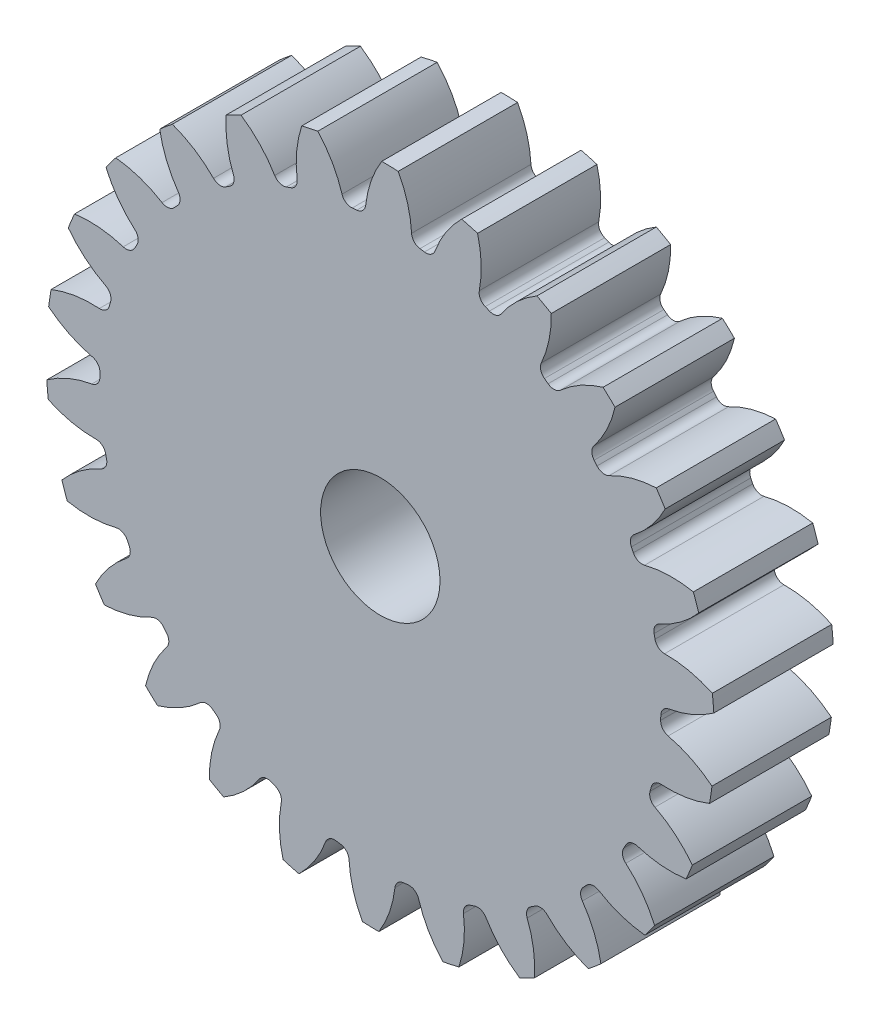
from build123d import *

# Parameters (mm, degrees)
SKETCH3_R         = 284.48
GEARBODY_DEPTH    = 101.6
TOOTHCUT_DEPTH    = 415.946142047
CIRPATTERN1_COUNT = 26
BOREDIA_R         = 50.8
BORE_DEPTH        = 12700


with BuildPart() as part:
    # Sketch3 → gearBody (new body)
    with BuildSketch(Plane.XY):
        Circle(SKETCH3_R)
    extrude(amount=GEARBODY_DEPTH)

    # Sketch2 → toothCut (cut, through all)
    with BuildSketch(Plane.XY):
        with BuildLine():
            ThreePointArc((238.596342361, -8.838722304), (238.660131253, -6.905023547), (238.708248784, -4.97087138))
            ThreePointArc((238.708248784, -4.97087138), (240.697371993, 0.239042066), (245.541681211, 3.001735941))
            ThreePointArc((245.541681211, 3.001735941), (265.963471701, 9.066514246), (284.48, 19.600708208))
            ThreePointArc((284.48, 19.600708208), (285.035171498, -8.24676732), (282.870884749, -36.015562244))
            ThreePointArc((282.870884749, -36.015562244), (264.994380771, -24.428428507), (244.957395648, -17.193078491))
            ThreePointArc((244.957395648, -17.193078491), (240.280919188, -14.154924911), (238.596342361, -8.838722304))
        make_face()
    toothcut = extrude(amount=TOOTHCUT_DEPTH, mode=Mode.SUBTRACT)

    # CirPattern1: toothCut ×26 about axis
    cirpattern1_axis = Axis((0, 0, 0), (0, 0, 1))
    for i in range(1, CIRPATTERN1_COUNT):
        add(toothcut.rotate(cirpattern1_axis, i * 360 / CIRPATTERN1_COUNT), mode=Mode.SUBTRACT)

    # boreDia → bore (cut, symmetric)
    with BuildSketch(Plane.XY):
        Circle(BOREDIA_R)
    extrude(amount=BORE_DEPTH, both=True, mode=Mode.SUBTRACT)


solid = part.part
